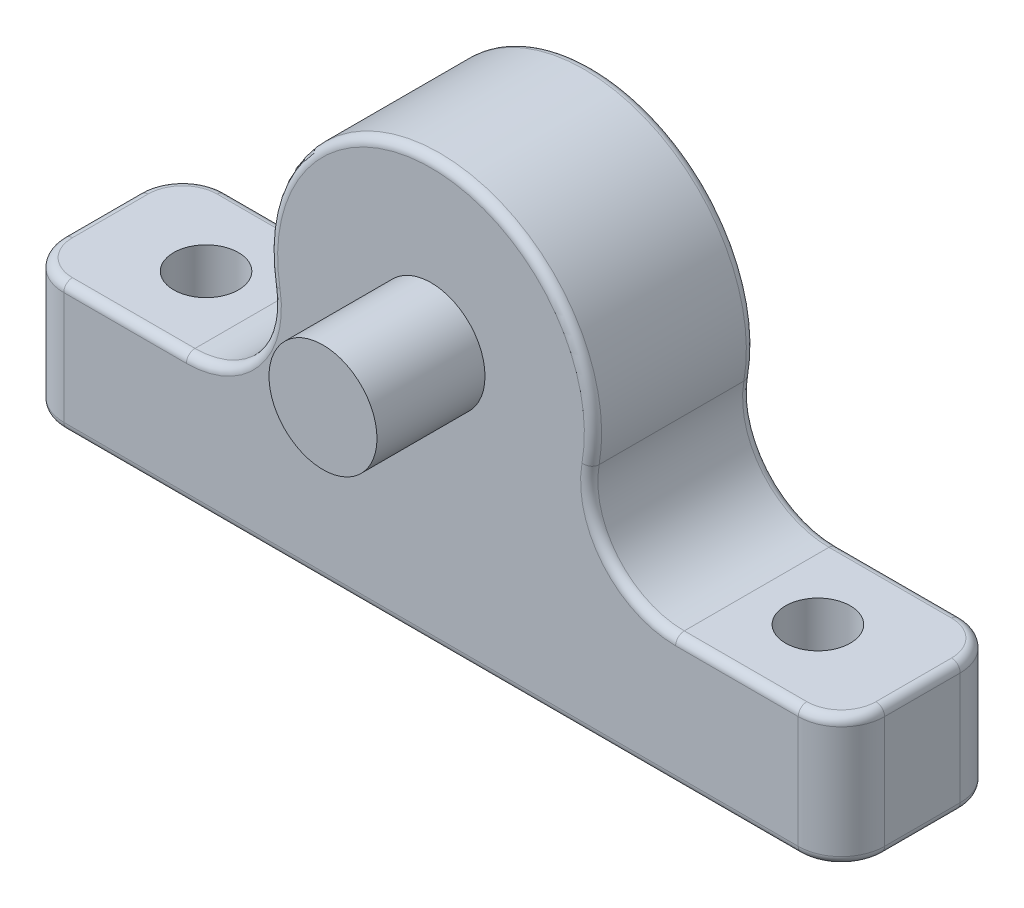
from build123d import *

# Parameters (mm, degrees)
SKETCH1_R                  = 37.5
EXTRUDE1_DEPTH             = 37.5
EXTRUDE4_START             = 37.5
SKETCH1_4_R                = 12.5
EXTRUDE4_DEPTH             = 25
SKETCH2_W                  = 190
SKETCH2_H                  = 30
EXTRUDE6_DEPTH             = 37.5
FILLET1_R                  = 20
FILLET2_R                  = 10
FILLET3_R                  = 2
F_15_0_15_DIAMETER_HOLE1_D = 15


with BuildPart() as part:
    # Sketch1 → Extrude1 (new body)
    with BuildSketch(Plane.XY):
        Circle(SKETCH1_R)
    extrude(amount=EXTRUDE1_DEPTH)

    # Sketch1_4 → Extrude4 (add)
    with BuildSketch(Plane.XY.offset(EXTRUDE4_START)):
        Circle(SKETCH1_4_R)
    extrude(amount=EXTRUDE4_DEPTH)

    # Sketch2 → Extrude6 (add)
    with BuildSketch(Plane.XY.offset(37.5)):
        with Locations((0, -45)):
            Rectangle(SKETCH2_W, SKETCH2_H)
    extrude(amount=-EXTRUDE6_DEPTH)

    # Fillet1
    fillet1_edges = [part.edges().sort_by_distance(p)[0] for p in [
        (22.5, -30, 18.75),
        (-22.5, -30, 18.75),
    ]]
    fillet(fillet1_edges, radius=FILLET1_R)

    # Fillet2
    fillet2_edges = [part.edges().sort_by_distance(p)[0] for p in [
        (-95, -45, 37.5),
        (95, -45, 37.5),
        (95, -45, 0),
        (-95, -45, 0),
    ]]
    fillet(fillet2_edges, radius=FILLET2_R)

    # Fillet3
    fillet3_edges = [part.edges().sort_by_distance(p)[0] for p in [
        (0, 37.5, 37.5),
        (0, 37.5, 0),
        (70.811879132, -30, 0),
        (-70.811879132, -30, 37.5),
        (41.301140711, -22.853691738, 0),
        (41.301140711, -22.853691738, 37.5),
        (-41.301140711, -22.853691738, 37.5),
        (-41.301140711, -22.853691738, 0),
        (0, -60, 0),
        (-70.811879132, -30, 0),
        (-95, -30, 18.75),
        (-92.071067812, -30, 34.571067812),
        (-92.071067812, -30, 2.928932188),
        (-95, -60, 18.75),
        (95, -60, 18.75),
        (0, -60, 37.5),
        (-92.071067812, -60, 34.571067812),
        (92.071067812, -60, 2.928932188),
        (92.071067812, -60, 34.571067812),
        (-92.071067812, -60, 2.928932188),
        (70.811879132, -30, 37.5),
        (95, -30, 18.75),
        (92.071067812, -30, 2.928932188),
        (92.071067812, -30, 34.571067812),
    ]]
    fillet(fillet3_edges, radius=FILLET3_R)

    # 15.0 _15_ Diameter Hole1 (through all)
    with Locations(Plane(origin=(0, -30, 0), x_dir=(-1, 0, 0), z_dir=(0, 1, 0))):
        with Locations((70.811879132, 18.75), (-70.811879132, 18.75)):
            Hole(F_15_0_15_DIAMETER_HOLE1_D / 2)


solid = part.part
